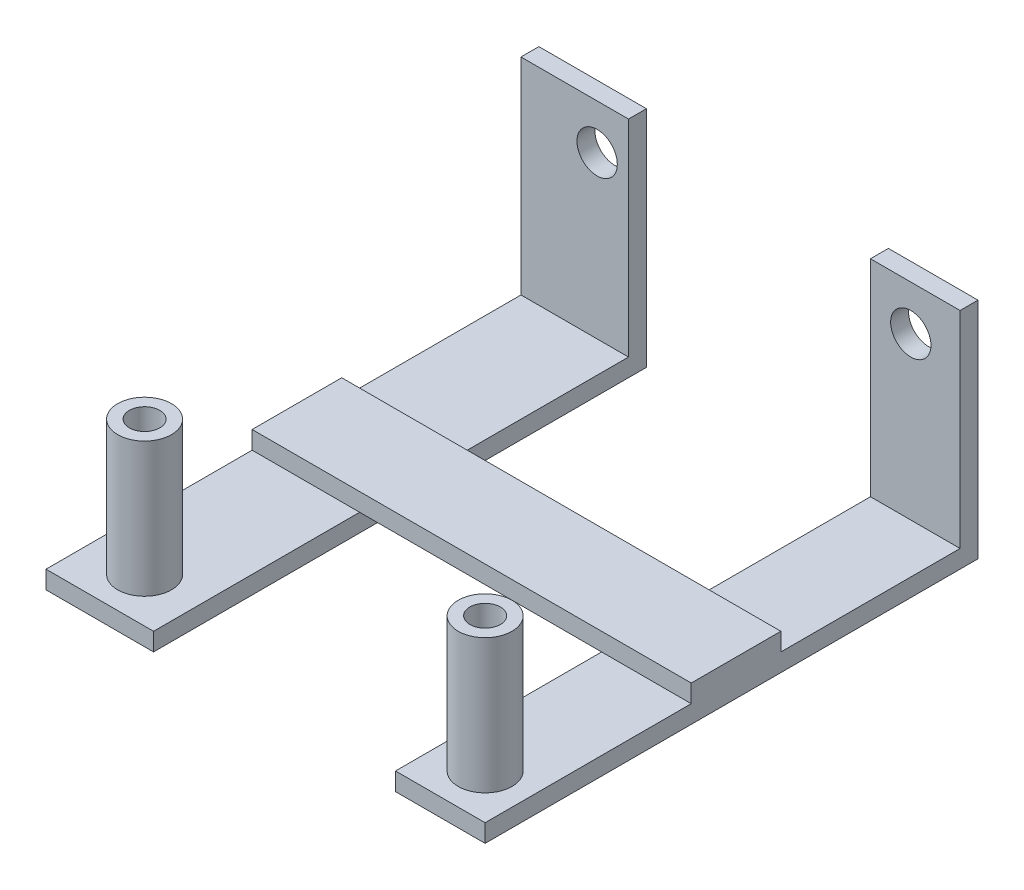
from build123d import *

# Parameters (mm, degrees)
SCHIZZO16_R                    = 3
ESTRUSIONE_ESTRUSIONE8_DEPTH   = 15
ESTRUSIONE_ESTRUSIONE8_2_DEPTH = 15
SCHIZZO17_W                    = 12
SCHIZZO17_H                    = 53
SCHIZZO17_W_2                  = 10
ESTRUSIONE_ESTRUSIONE9_DEPTH   = 2
SCHIZZO18_W                    = 10
SCHIZZO18_H                    = 25
SCHIZZO18_W_2                  = 12
ESTRUSIONE_ESTRUSIONE10_DEPTH  = 2
FORO_PER_VITE_M4_4_D           = 4.5
FORO_PER_VITE_M3_2_D           = 3.4
SCHIZZO23_W                    = 49
SCHIZZO23_H                    = 10
ESTRUSIONE_ESTRUSIONE11_DEPTH  = 2


with BuildPart() as part:
    # Schizzo16 → Estrusione-Estrusione8 (new body)
    with BuildSketch(Plane(origin=(0, 0, 0), x_dir=(1, 0, 0), z_dir=(0, 1, 0))):
        with Locations(Location((-20, 0, 0), (0, 0, 270))):
            Circle(SCHIZZO16_R)
    extrude(amount=ESTRUSIONE_ESTRUSIONE8_DEPTH)



with BuildPart() as body_2:
    # Schizzo16 → Estrusione-Estrusione8 2 (new body)
    with BuildSketch(Plane(origin=(0, 0, 0), x_dir=(1, 0, 0), z_dir=(0, 1, 0))):
        with Locations(Location((18, 0, 0), (0, 0, 270))):
            Circle(SCHIZZO16_R)
    extrude(amount=ESTRUSIONE_ESTRUSIONE8_2_DEPTH)


with BuildPart() as part_1:
    add(part.part)

    add(body_2.part)  # Estrusione-Estrusione9 merges body 2
    # Schizzo17 → Estrusione-Estrusione9 (add)
    with BuildSketch(Plane(origin=(0, 0, 0), x_dir=(-1, 0, 0), z_dir=(0, -1, 0))):
        with Locations((20, 21.5)):
            Rectangle(SCHIZZO17_W, SCHIZZO17_H)
        with Locations((-18, 21.5)):
            Rectangle(SCHIZZO17_W_2, SCHIZZO17_H)
    extrude(amount=ESTRUSIONE_ESTRUSIONE9_DEPTH)

    # Schizzo18 → Estrusione-Estrusione10 (add)
    with BuildSketch(Plane(origin=(0, 0, -48), x_dir=(-1, 0, 0), z_dir=(0, 0, -1))):
        with Locations((-18, 10.5)):
            Rectangle(SCHIZZO18_W, SCHIZZO18_H)
        with Locations((20, 10.5)):
            Rectangle(SCHIZZO18_W_2, SCHIZZO18_H)
    extrude(amount=ESTRUSIONE_ESTRUSIONE10_DEPTH)

    # Foro per Vite M4-4 (through all)
    with Locations(Plane(origin=(0, 0, -50), x_dir=(-1, 0, 0), z_dir=(0, 0, -1))):
        with Locations((-17.5, 18), (17.5, 18)):
            Hole(FORO_PER_VITE_M4_4_D / 2)

    # Foro per Vite M3-2 (through all)
    with Locations(Plane(origin=(0, 15, 0), x_dir=(1, 0, 0), z_dir=(0, 1, 0))):
        with Locations((-20, 0), (18, 0)):
            Hole(FORO_PER_VITE_M3_2_D / 2)

    # Schizzo23 → Estrusione-Estrusione11 (add)
    with BuildSketch(Plane(origin=(0, 0, 0), x_dir=(1, 0, 0), z_dir=(0, 1, 0))):
        with Locations((-1.5, 23)):
            Rectangle(SCHIZZO23_W, SCHIZZO23_H)
    extrude(amount=ESTRUSIONE_ESTRUSIONE11_DEPTH)


solid = part_1.part
